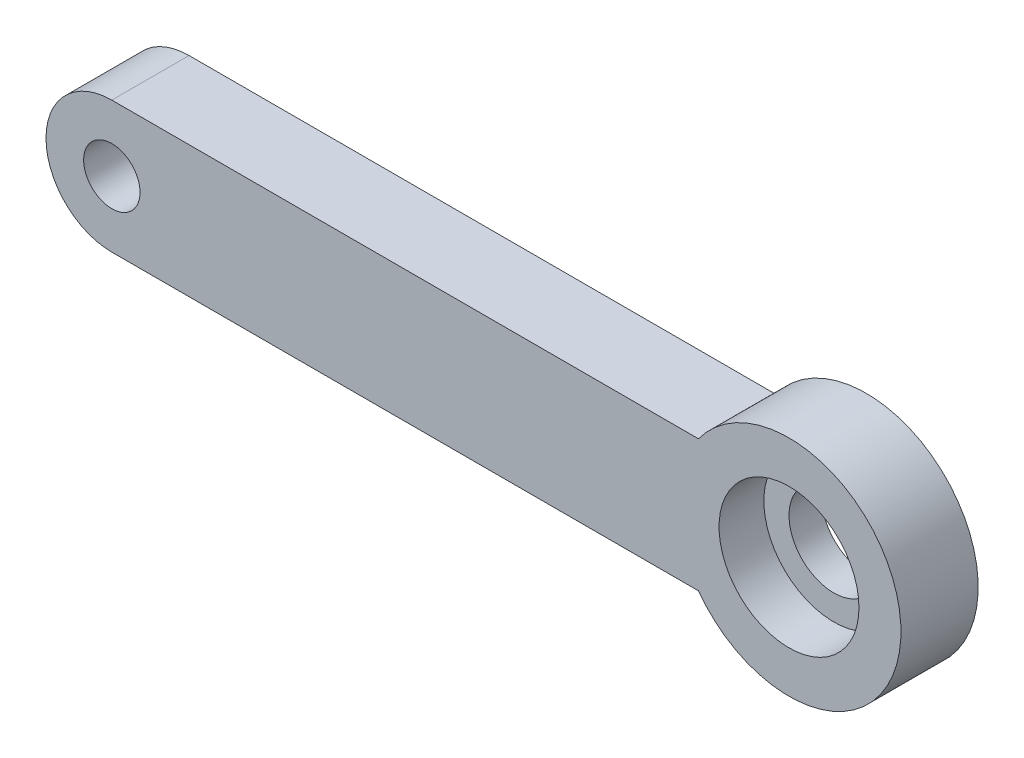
from build123d import *

# Parameters (mm, degrees)
SKETCH1_R           = 5.08
SKETCH1_R_2         = 3.2004
BOSS_EXTRUDE1_DEPTH = 8.763
SKETCH2_R           = 7.9375
CUT_EXTRUDE1_DEPTH  = 5.08


with BuildPart() as part:
    # Sketch1 → Boss-Extrude1 (new body)
    with BuildSketch(Plane.XY):
        with BuildLine():
            Line((-76.835, 7.470047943), (-10.270753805, 7.470047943))
            ThreePointArc((-10.270753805, 7.470047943), (12.7, 0), (-10.270753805, -7.470047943))
            Line((-10.270753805, -7.470047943), (-76.835, -7.470047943))
            ThreePointArc((-76.835, -7.470047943), (-84.305047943, 0), (-76.835, 7.470047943))
        make_face()
        Circle(SKETCH1_R, mode=Mode.SUBTRACT)
        with Locations((-76.835, 0)):
            Circle(SKETCH1_R_2, mode=Mode.SUBTRACT)
    extrude(amount=BOSS_EXTRUDE1_DEPTH)

    # Sketch2 → Cut-Extrude1 (cut)
    with BuildSketch(Plane.XY.offset(8.763)):
        Circle(SKETCH2_R)
    extrude(amount=-CUT_EXTRUDE1_DEPTH, mode=Mode.SUBTRACT)


solid = part.part
